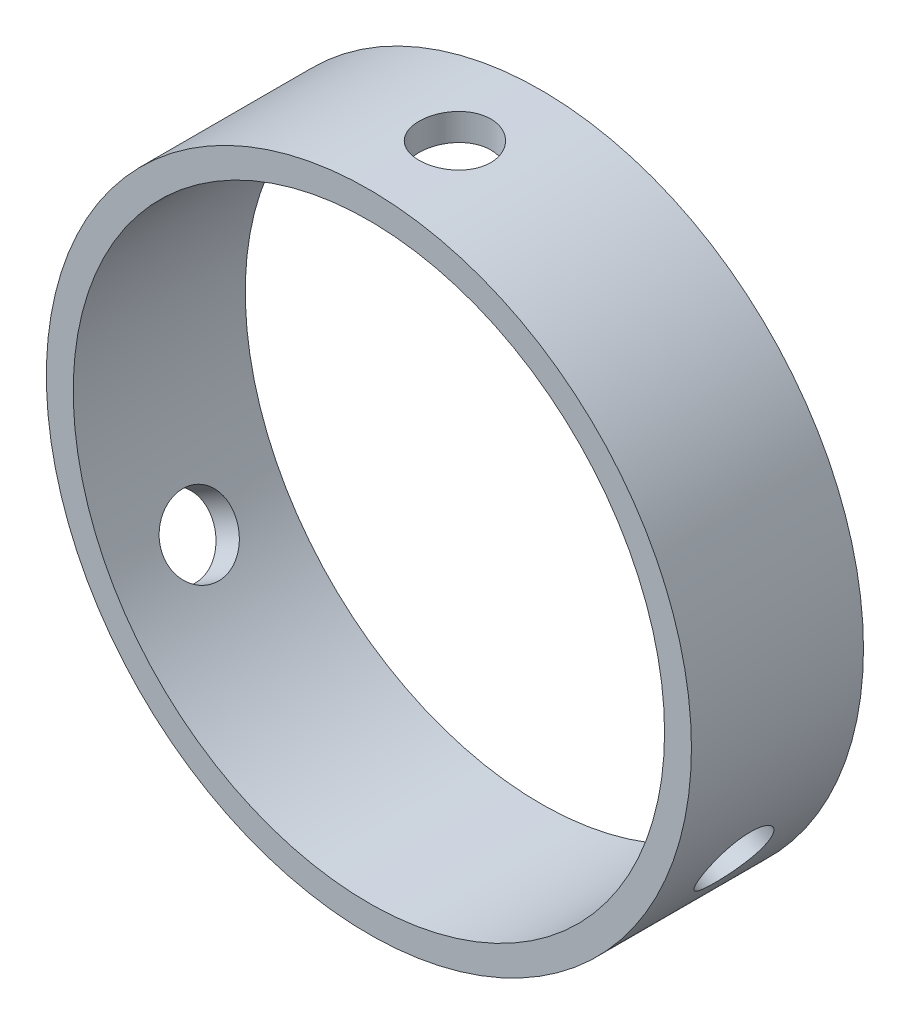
ISO-10303-21;
HEADER;
FILE_DESCRIPTION(('STEP AP214'),'2;1');
FILE_NAME('part.step','',(''),(''),'','','');
FILE_SCHEMA(('AUTOMOTIVE_DESIGN { 1 0 10303 214 1 1 1 1 }'));
ENDSEC;
DATA;
#1=APPLICATION_CONTEXT('core data for automotive mechanical design processes');
#2=APPLICATION_PROTOCOL_DEFINITION('international standard','automotive_design',2000,#1);
#3=PRODUCT_CONTEXT('',#1,'mechanical');
#4=PRODUCT('Part','Part','',(#3));
#5=PRODUCT_RELATED_PRODUCT_CATEGORY('part','',(#4));
#6=PRODUCT_DEFINITION_FORMATION('','',#4);
#7=PRODUCT_DEFINITION_CONTEXT('part definition',#1,'design');
#8=PRODUCT_DEFINITION('design','',#6,#7);
#9=PRODUCT_DEFINITION_SHAPE('','',#8);
#10=(LENGTH_UNIT() NAMED_UNIT(*) SI_UNIT(.MILLI.,.METRE.));
#11=(NAMED_UNIT(*) PLANE_ANGLE_UNIT() SI_UNIT($,.RADIAN.));
#12=(NAMED_UNIT(*) SI_UNIT($,.STERADIAN.) SOLID_ANGLE_UNIT());
#13=UNCERTAINTY_MEASURE_WITH_UNIT(LENGTH_MEASURE(1.E-05),#10,'distance_accuracy_value','');
#14=(GEOMETRIC_REPRESENTATION_CONTEXT(3) GLOBAL_UNCERTAINTY_ASSIGNED_CONTEXT((#13)) GLOBAL_UNIT_ASSIGNED_CONTEXT((#10,
#11,#12)) REPRESENTATION_CONTEXT('',''));
#15=CARTESIAN_POINT('',(0.,0.,0.));
#16=DIRECTION('',(0.,0.,1.));
#17=DIRECTION('',(1.,0.,0.));
#18=AXIS2_PLACEMENT_3D('',#15,#16,#17);
#19=CARTESIAN_POINT('',(0.,0.,15.24));
#20=DIRECTION('',(0.,0.,1.));
#21=DIRECTION('',(1.,0.,0.));
#22=AXIS2_PLACEMENT_3D('',#19,#20,#21);
#23=PLANE('',#22);
#24=CARTESIAN_POINT('',(0.,0.,15.24));
#25=DIRECTION('',(0.,0.,1.));
#26=DIRECTION('',(1.,0.,0.));
#27=AXIS2_PLACEMENT_3D('',#24,#25,#26);
#28=CIRCLE('',#27,57.15);
#29=CARTESIAN_POINT('',(57.15,0.,15.24));
#30=VERTEX_POINT('',#29);
#31=EDGE_CURVE('E10',#30,#30,#28,.T.);
#32=ORIENTED_EDGE('',*,*,#31,.T.);
#33=EDGE_LOOP('',(#32));
#34=FACE_BOUND('',#33,.T.);
#35=CARTESIAN_POINT('',(0.,0.,15.24));
#36=DIRECTION('',(0.,0.,1.));
#37=DIRECTION('',(1.,0.,0.));
#38=AXIS2_PLACEMENT_3D('',#35,#36,#37);
#39=CIRCLE('',#38,52.3875);
#40=CARTESIAN_POINT('',(52.3875,0.,15.24));
#41=VERTEX_POINT('',#40);
#42=EDGE_CURVE('E41',#41,#41,#39,.T.);
#43=ORIENTED_EDGE('',*,*,#42,.F.);
#44=EDGE_LOOP('',(#43));
#45=FACE_BOUND('',#44,.T.);
#46=ADVANCED_FACE('F30',(#34,#45),#23,.T.);
#47=CARTESIAN_POINT('',(0.,0.,-15.24));
#48=DIRECTION('',(0.,0.,1.));
#49=DIRECTION('',(1.,0.,0.));
#50=AXIS2_PLACEMENT_3D('',#47,#48,#49);
#51=PLANE('',#50);
#52=CARTESIAN_POINT('',(0.,0.,-15.24));
#53=DIRECTION('',(0.,0.,1.));
#54=DIRECTION('',(1.,0.,0.));
#55=AXIS2_PLACEMENT_3D('',#52,#53,#54);
#56=CIRCLE('',#55,57.15);
#57=CARTESIAN_POINT('',(57.15,0.,-15.24));
#58=VERTEX_POINT('',#57);
#59=EDGE_CURVE('E37',#58,#58,#56,.T.);
#60=ORIENTED_EDGE('',*,*,#59,.F.);
#61=EDGE_LOOP('',(#60));
#62=FACE_BOUND('',#61,.T.);
#63=CARTESIAN_POINT('',(0.,0.,-15.24));
#64=DIRECTION('',(0.,0.,1.));
#65=DIRECTION('',(1.,0.,0.));
#66=AXIS2_PLACEMENT_3D('',#63,#64,#65);
#67=CIRCLE('',#66,52.3875);
#68=CARTESIAN_POINT('',(52.3875,0.,-15.24));
#69=VERTEX_POINT('',#68);
#70=EDGE_CURVE('E45',#69,#69,#67,.T.);
#71=ORIENTED_EDGE('',*,*,#70,.T.);
#72=EDGE_LOOP('',(#71));
#73=FACE_BOUND('',#72,.T.);
#74=ADVANCED_FACE('F114',(#62,#73),#51,.F.);
#75=CARTESIAN_POINT('',(0.,0.,15.24));
#76=DIRECTION('',(0.,0.,-1.));
#77=DIRECTION('',(-1.,0.,0.));
#78=AXIS2_PLACEMENT_3D('',#75,#76,#77);
#79=CYLINDRICAL_SURFACE('',#78,57.15);
#80=CARTESIAN_POINT('',(-46.0118884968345,-33.8973246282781,0.));
#81=CARTESIAN_POINT('',(-46.0118870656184,-33.8973259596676,0.1778122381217));
#82=CARTESIAN_POINT('',(-46.0163488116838,-33.8912725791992,0.355596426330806));
#83=CARTESIAN_POINT('',(-46.0341459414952,-33.8670952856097,0.709952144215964));
#84=CARTESIAN_POINT('',(-46.0474834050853,-33.8489685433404,0.886523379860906));
#85=CARTESIAN_POINT('',(-46.0829049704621,-33.8007287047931,1.23726980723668));
#86=CARTESIAN_POINT('',(-46.1049958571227,-33.7706063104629,1.41144303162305));
#87=CARTESIAN_POINT('',(-46.1576955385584,-33.6985405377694,1.75608310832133));
#88=CARTESIAN_POINT('',(-46.1883074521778,-33.6565928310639,1.92654857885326));
#89=CARTESIAN_POINT('',(-46.2576849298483,-33.5611763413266,2.26232926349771));
#90=CARTESIAN_POINT('',(-46.2964422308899,-33.507719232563,2.42764950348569));
#91=CARTESIAN_POINT('',(-46.3817391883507,-33.3895504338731,2.75221864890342));
#92=CARTESIAN_POINT('',(-46.4282817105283,-33.3248345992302,2.91146529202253));
#93=CARTESIAN_POINT('',(-46.5286319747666,-33.1845797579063,3.22262180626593));
#94=CARTESIAN_POINT('',(-46.582435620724,-33.1090468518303,3.37453574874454));
#95=CARTESIAN_POINT('',(-46.6968070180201,-32.9475417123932,3.6701211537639));
#96=CARTESIAN_POINT('',(-46.757377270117,-32.8615656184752,3.81378953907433));
#97=CARTESIAN_POINT('',(-46.8848968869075,-32.6793719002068,4.09232713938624));
#98=CARTESIAN_POINT('',(-46.9518684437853,-32.5831185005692,4.22716279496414));
#99=CARTESIAN_POINT('',(-47.0913793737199,-32.381160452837,4.48657227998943));
#100=CARTESIAN_POINT('',(-47.1639207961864,-32.2754523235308,4.61114229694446));
#101=CARTESIAN_POINT('',(-47.3138346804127,-32.0552846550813,4.84905379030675));
#102=CARTESIAN_POINT('',(-47.3912055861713,-31.9408279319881,4.96239885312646));
#103=CARTESIAN_POINT('',(-47.5501084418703,-31.7037860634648,5.17714752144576));
#104=CARTESIAN_POINT('',(-47.6316419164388,-31.5811979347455,5.2785467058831));
#105=CARTESIAN_POINT('',(-47.7982888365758,-31.3284063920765,5.46884862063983));
#106=CARTESIAN_POINT('',(-47.883409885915,-31.1981865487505,5.55772287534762));
#107=CARTESIAN_POINT('',(-48.0563311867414,-30.9311630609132,5.72209622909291));
#108=CARTESIAN_POINT('',(-48.1441324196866,-30.7943569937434,5.79759035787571));
#109=CARTESIAN_POINT('',(-48.3215932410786,-30.515134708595,5.93458795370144));
#110=CARTESIAN_POINT('',(-48.4112520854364,-30.3727207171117,5.99609690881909));
#111=CARTESIAN_POINT('',(-48.5917059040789,-30.0831817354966,6.10472910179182));
#112=CARTESIAN_POINT('',(-48.6825012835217,-29.9360550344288,6.15184704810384));
#113=CARTESIAN_POINT('',(-48.9546451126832,-29.4904280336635,6.27064807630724));
#114=CARTESIAN_POINT('',(-49.1366928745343,-29.1862035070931,6.32050140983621));
#115=CARTESIAN_POINT('',(-49.4965717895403,-28.5716453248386,6.36001929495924));
#116=CARTESIAN_POINT('',(-49.6744030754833,-28.2613118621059,6.3496857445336));
#117=CARTESIAN_POINT('',(-50.0202000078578,-27.6446459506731,6.26939983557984));
#118=CARTESIAN_POINT('',(-50.1882057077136,-27.3383018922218,6.19971062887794));
#119=CARTESIAN_POINT('',(-50.5109738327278,-26.7372493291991,6.00308110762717));
#120=CARTESIAN_POINT('',(-50.6657360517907,-26.4425410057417,5.87613990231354));
#121=CARTESIAN_POINT('',(-50.9589714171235,-25.8729331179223,5.56833042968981));
#122=CARTESIAN_POINT('',(-51.0974088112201,-25.598077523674,5.38734675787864));
#123=CARTESIAN_POINT('',(-51.3550280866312,-25.0772436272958,4.97667216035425));
#124=CARTESIAN_POINT('',(-51.4742092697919,-24.8312663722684,4.74697946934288));
#125=CARTESIAN_POINT('',(-51.6920298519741,-24.3745982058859,4.2439295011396));
#126=CARTESIAN_POINT('',(-51.7905548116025,-24.1641050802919,3.97034306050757));
#127=CARTESIAN_POINT('',(-51.964926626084,-23.7868080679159,3.38806306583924));
#128=CARTESIAN_POINT('',(-52.0407734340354,-23.62000427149,3.07936943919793));
#129=CARTESIAN_POINT('',(-52.168939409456,-23.3355678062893,2.43545050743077));
#130=CARTESIAN_POINT('',(-52.2212517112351,-23.2179494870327,2.10021749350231));
#131=CARTESIAN_POINT('',(-52.3017825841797,-23.0359725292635,1.4128305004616));
#132=CARTESIAN_POINT('',(-52.3300020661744,-22.9716118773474,1.06067716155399));
#133=CARTESIAN_POINT('',(-52.3619997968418,-22.898582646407,0.35145696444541));
#134=CARTESIAN_POINT('',(-52.3659076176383,-22.889618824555,-0.00557366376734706));
#135=CARTESIAN_POINT('',(-52.3495923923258,-22.9269072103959,-0.716177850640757));
#136=CARTESIAN_POINT('',(-52.3293697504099,-22.9731584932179,-1.06975146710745));
#137=CARTESIAN_POINT('',(-52.2650644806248,-23.1190786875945,-1.76245991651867));
#138=CARTESIAN_POINT('',(-52.2210446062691,-23.2186071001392,-2.10163020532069));
#139=CARTESIAN_POINT('',(-52.1096118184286,-23.4676235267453,-2.75700925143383));
#140=CARTESIAN_POINT('',(-52.0421982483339,-23.6171129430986,-3.07321736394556));
#141=CARTESIAN_POINT('',(-51.8843730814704,-23.9618505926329,-3.67515233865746));
#142=CARTESIAN_POINT('',(-51.7938662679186,-24.1572880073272,-3.96074587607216));
#143=CARTESIAN_POINT('',(-51.5911284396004,-24.5872795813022,-4.49198913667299));
#144=CARTESIAN_POINT('',(-51.4788967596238,-24.8218349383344,-4.73763763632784));
#145=CARTESIAN_POINT('',(-51.2338277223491,-25.323815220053,-5.18313199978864));
#146=CARTESIAN_POINT('',(-51.1009004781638,-25.5913824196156,-5.38276816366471));
#147=CARTESIAN_POINT('',(-50.8171689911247,-26.1502557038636,-5.72912280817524));
#148=CARTESIAN_POINT('',(-50.6663650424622,-26.4415613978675,-5.8758421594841));
#149=CARTESIAN_POINT('',(-50.3504296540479,-27.0383150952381,-6.11185343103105));
#150=CARTESIAN_POINT('',(-50.185330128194,-27.3437309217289,-6.20126970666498));
#151=CARTESIAN_POINT('',(-49.8443969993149,-27.96037101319,-6.32051726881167));
#152=CARTESIAN_POINT('',(-49.6685637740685,-28.2715950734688,-6.35035065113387));
#153=CARTESIAN_POINT('',(-49.4011212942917,-28.7347114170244,-6.34982016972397));
#154=CARTESIAN_POINT('',(-49.3115567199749,-28.8881345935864,-6.34216191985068));
#155=CARTESIAN_POINT('',(-49.1316620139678,-29.1930386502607,-6.3119902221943));
#156=CARTESIAN_POINT('',(-49.0413321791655,-29.344520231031,-6.28948229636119));
#157=CARTESIAN_POINT('',(-48.8605568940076,-29.6445475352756,-6.22975908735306));
#158=CARTESIAN_POINT('',(-48.7701114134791,-29.7930921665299,-6.19253843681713));
#159=CARTESIAN_POINT('',(-48.5898781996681,-30.0861398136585,-6.10368229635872));
#160=CARTESIAN_POINT('',(-48.500090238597,-30.23064428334,-6.05205206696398));
#161=CARTESIAN_POINT('',(-48.3218608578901,-30.5147241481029,-5.93473684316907));
#162=CARTESIAN_POINT('',(-48.2334196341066,-30.6542988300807,-5.86904982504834));
#163=CARTESIAN_POINT('',(-48.0586720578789,-30.9275416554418,-5.72412512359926));
#164=CARTESIAN_POINT('',(-47.9723649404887,-31.0612119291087,-5.64489237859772));
#165=CARTESIAN_POINT('',(-47.8025667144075,-31.3218984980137,-5.47339322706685));
#166=CARTESIAN_POINT('',(-47.719076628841,-31.4489123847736,-5.3811221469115));
#167=CARTESIAN_POINT('',(-47.55571405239,-31.6954005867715,-5.18425529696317));
#168=CARTESIAN_POINT('',(-47.4758402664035,-31.8148776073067,-5.0796639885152));
#169=CARTESIAN_POINT('',(-47.3199699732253,-32.0462558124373,-4.85824813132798));
#170=CARTESIAN_POINT('',(-47.2439974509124,-32.1581112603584,-4.74135889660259));
#171=CARTESIAN_POINT('',(-47.097148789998,-32.3727970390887,-4.49669768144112));
#172=CARTESIAN_POINT('',(-47.0262708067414,-32.4756306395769,-4.36892967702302));
#173=CARTESIAN_POINT('',(-46.890218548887,-32.6717639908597,-4.10328703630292));
#174=CARTESIAN_POINT('',(-46.8250477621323,-32.7650579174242,-3.96540631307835));
#175=CARTESIAN_POINT('',(-46.7011206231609,-32.9414549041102,-3.68062394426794));
#176=CARTESIAN_POINT('',(-46.6423619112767,-33.0245617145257,-3.53372564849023));
#177=CARTESIAN_POINT('',(-46.5316284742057,-33.1804042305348,-3.23136658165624));
#178=CARTESIAN_POINT('',(-46.4796779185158,-33.2531030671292,-3.07587794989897));
#179=CARTESIAN_POINT('',(-46.3833533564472,-33.3873307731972,-2.75796380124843));
#180=CARTESIAN_POINT('',(-46.3389765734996,-33.4488637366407,-2.59554085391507));
#181=CARTESIAN_POINT('',(-46.2582739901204,-33.5603832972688,-2.26498564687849));
#182=CARTESIAN_POINT('',(-46.2219417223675,-33.6103791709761,-2.0968580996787));
#183=CARTESIAN_POINT('',(-46.1576782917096,-33.6985786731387,-1.7560277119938));
#184=CARTESIAN_POINT('',(-46.1297450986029,-33.7367851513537,-1.58332598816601));
#185=CARTESIAN_POINT('',(-46.0749405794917,-33.8116132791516,-1.17808987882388));
#186=CARTESIAN_POINT('',(-46.0513314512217,-33.8437301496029,-0.944260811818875));
#187=CARTESIAN_POINT('',(-46.0198064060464,-33.8865848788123,-0.473604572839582));
#188=CARTESIAN_POINT('',(-46.0118904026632,-33.8973228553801,-0.236777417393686));
#189=CARTESIAN_POINT('',(-46.0118884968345,-33.8973246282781,0.));
#190=B_SPLINE_CURVE_WITH_KNOTS('',3,(#80,#81,#82,#83,#84,#85,#86,#87,#88,#89,#90,#91,#92,#93,
#94,#95,#96,#97,#98,#99,#100,#101,#102,#103,#104,#105,#106,#107,#108,#109,#110,#111,#112,#113,
#114,#115,#116,#117,#118,#119,#120,#121,#122,#123,#124,#125,#126,#127,#128,#129,#130,#131,#132,
#133,#134,#135,#136,#137,#138,#139,#140,#141,#142,#143,#144,#145,#146,#147,#148,#149,#150,#151,
#152,#153,#154,#155,#156,#157,#158,#159,#160,#161,#162,#163,#164,#165,#166,#167,#168,#169,#170,
#171,#172,#173,#174,#175,#176,#177,#178,#179,#180,#181,#182,#183,#184,#185,#186,#187,#188,#189),
.UNSPECIFIED.,.T.,.F.,(4,2,2,2,2,2,2,2,2,2,2,2,2,2,2,2,2,2,2,2,2,2,2,2,2,2,2,2,2,2,2,2,2,2,2,2,
2,2,2,2,2,2,2,2,2,2,2,2,2,2,2,2,2,2,4),(0.,0.533229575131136,1.06658414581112,1.60035293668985,
2.13431735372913,2.66774268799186,3.20136481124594,3.73468715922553,4.26820726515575,
4.80364915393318,5.33928900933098,5.8747571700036,6.41042288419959,6.94728744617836,
7.48435101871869,8.02120347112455,8.55825308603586,9.62673898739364,10.695191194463,
11.7589309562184,12.822687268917,13.8887316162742,14.9548146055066,16.0266563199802,
17.0985002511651,18.1706566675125,19.2427725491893,20.3091695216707,21.3755486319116,
22.4391293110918,23.5027398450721,24.5708087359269,25.6389103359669,26.7117875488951,
27.7846471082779,28.8551704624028,29.925656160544,30.458590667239,30.9913271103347,
31.5242580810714,32.0569947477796,32.5898081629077,33.1224277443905,33.6552387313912,
34.1878573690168,34.7234326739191,35.2588130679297,35.7945183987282,36.3300259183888,
36.8673858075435,37.4045482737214,37.941277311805,38.4778765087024,39.187936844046,
39.8979932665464),.UNSPECIFIED.);
#191=CARTESIAN_POINT('',(-46.0118884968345,-33.8973246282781,0.));
#192=VERTEX_POINT('',#191);
#193=EDGE_CURVE('E96',#192,#192,#190,.T.);
#194=ORIENTED_EDGE('',*,*,#193,.F.);
#195=EDGE_LOOP('',(#194));
#196=FACE_BOUND('',#195,.T.);
#197=CARTESIAN_POINT('',(52.3618884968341,-22.8988020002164,0.));
#198=CARTESIAN_POINT('',(52.3618889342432,-22.8988000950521,0.1778122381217));
#199=CARTESIAN_POINT('',(52.3588774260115,-22.9056907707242,0.355596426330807));
#200=CARTESIAN_POINT('',(52.3468378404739,-22.93319218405,0.709952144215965));
#201=CARTESIAN_POINT('',(52.3378083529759,-22.9538061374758,0.886523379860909));
#202=CARTESIAN_POINT('',(52.3137422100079,-23.0086020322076,1.23726980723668));
#203=CARTESIAN_POINT('',(52.2987008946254,-23.0427944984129,1.41144303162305));
#204=CARTESIAN_POINT('',(52.2626399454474,-23.1244666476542,1.75608310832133));
#205=CARTESIAN_POINT('',(52.2416181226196,-23.1719511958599,1.92654857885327));
#206=CARTESIAN_POINT('',(52.1936737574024,-23.2797420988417,2.26232926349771));
#207=CARTESIAN_POINT('',(52.166757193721,-23.3400354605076,2.42764950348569));
#208=CARTESIAN_POINT('',(52.1070684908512,-23.4729891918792,2.75221864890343));
#209=CARTESIAN_POINT('',(52.0742941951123,-23.5456541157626,2.91146529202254));
#210=CARTESIAN_POINT('',(52.0030050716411,-23.7026874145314,3.22262180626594));
#211=CARTESIAN_POINT('',(51.9644934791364,-23.7870491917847,3.37453574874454));
#212=CARTESIAN_POINT('',(51.8818116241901,-23.966850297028,3.67012115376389));
#213=CARTESIAN_POINT('',(51.8376392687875,-24.0622937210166,3.81378953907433));
#214=CARTESIAN_POINT('',(51.7436146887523,-24.2638258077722,4.09232713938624));
#215=CARTESIAN_POINT('',(51.6937425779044,-24.3699515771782,4.22716279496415));
#216=CARTESIAN_POINT('',(51.5885972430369,-24.5917506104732,4.48657227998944));
#217=CARTESIAN_POINT('',(51.5333220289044,-24.707427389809,4.61114229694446));
#218=CARTESIAN_POINT('',(51.4176081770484,-24.9473404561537,4.84905379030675));
#219=CARTESIAN_POINT('',(51.3571712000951,-25.0715739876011,4.96239885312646));
#220=CARTESIAN_POINT('',(51.2313383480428,-25.3277088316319,5.17714752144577));
#221=CARTESIAN_POINT('',(51.1659406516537,-25.4596129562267,5.27854670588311));
#222=CARTESIAN_POINT('',(51.0303402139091,-25.7303291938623,5.46884862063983));
#223=CARTESIAN_POINT('',(50.9601270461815,-25.8691561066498,5.55772287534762));
#224=CARTESIAN_POINT('',(50.8153385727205,-26.1524220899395,5.72209622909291));
#225=CARTESIAN_POINT('',(50.7407616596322,-26.2968632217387,5.79759035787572));
#226=CARTESIAN_POINT('',(50.5876784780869,-26.5901599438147,5.93458795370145));
#227=CARTESIAN_POINT('',(50.5091737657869,-26.7390137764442,5.9960969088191));
#228=CARTESIAN_POINT('',(50.3486525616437,-27.0400608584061,6.10472910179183));
#229=CARTESIAN_POINT('',(50.2666347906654,-27.1922553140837,6.15184704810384));
#230=CARTESIAN_POINT('',(50.0167824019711,-27.6507522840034,6.27064807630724));
#231=CARTESIAN_POINT('',(49.8443401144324,-27.9605225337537,6.32050140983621));
#232=CARTESIAN_POINT('',(49.4920565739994,-28.5794659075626,6.36001929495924));
#233=CARTESIAN_POINT('',(49.3122155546,-28.8886390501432,6.3496857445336));
#234=CARTESIAN_POINT('',(48.9510656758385,-29.4964409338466,6.26939983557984));
#235=CARTESIAN_POINT('',(48.7697667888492,-29.795110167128,6.19971062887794));
#236=CARTESIAN_POINT('',(48.4106240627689,-30.3751618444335,6.00308110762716));
#237=CARTESIAN_POINT('',(48.2327802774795,-30.6565440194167,5.87613990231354));
#238=CARTESIAN_POINT('',(47.8861030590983,-31.1952972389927,5.5683304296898));
#239=CARTESIAN_POINT('',(47.7172898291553,-31.4526153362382,5.38734675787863));
#240=CARTESIAN_POINT('',(47.3950440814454,-31.9361371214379,4.97667216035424));
#241=CARTESIAN_POINT('',(47.2416121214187,-32.1623396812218,4.74697946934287));
#242=CARTESIAN_POINT('',(46.9550361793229,-32.57931192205,4.24392950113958));
#243=CARTESIAN_POINT('',(46.8220062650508,-32.769883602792,3.97034306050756));
#244=CARTESIAN_POINT('',(46.582443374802,-33.109542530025,3.38806306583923));
#245=CARTESIAN_POINT('',(46.4759104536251,-33.2586296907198,3.07936943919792));
#246=CARTESIAN_POINT('',(46.293664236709,-33.5118429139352,2.43545050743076));
#247=CARTESIAN_POINT('',(46.2179599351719,-33.6159558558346,2.1002174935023));
#248=CARTESIAN_POINT('',(46.1006287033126,-33.7766861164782,1.41283050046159));
#249=CARTESIAN_POINT('',(46.0590004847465,-33.8333052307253,1.06067716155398));
#250=CARTESIAN_POINT('',(46.011754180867,-33.8975306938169,0.3514569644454));
#251=CARTESIAN_POINT('',(46.0059451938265,-33.9053968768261,-0.005573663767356));
#252=CARTESIAN_POINT('',(46.0300802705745,-33.8726232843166,-0.716177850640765));
#253=CARTESIAN_POINT('',(46.060023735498,-33.8319843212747,-1.06975146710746));
#254=CARTESIAN_POINT('',(46.1542416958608,-33.7033342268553,-1.76245991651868));
#255=CARTESIAN_POINT('',(46.218425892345,-33.6154476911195,-2.1016302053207));
#256=CARTESIAN_POINT('',(46.3783640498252,-33.3944358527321,-2.75700925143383));
#257=CARTESIAN_POINT('',(46.4741188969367,-33.2613092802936,-3.07321736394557));
#258=CARTESIAN_POINT('',(46.6937578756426,-32.9522598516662,-3.67515233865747));
#259=CARTESIAN_POINT('',(46.817758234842,-32.7761599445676,-3.96074587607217));
#260=CARTESIAN_POINT('',(47.0887729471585,-32.3855880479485,-4.49198913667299));
#261=CARTESIAN_POINT('',(47.2357880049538,-32.1711148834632,-4.73763763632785));
#262=CARTESIAN_POINT('',(47.5479811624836,-31.7078887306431,-5.18313199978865));
#263=CARTESIAN_POINT('',(47.7132375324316,-31.4589867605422,-5.38276816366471));
#264=CARTESIAN_POINT('',(48.0553702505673,-30.9338314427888,-5.72912280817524));
#265=CARTESIAN_POINT('',(48.2322464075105,-30.6575785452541,-5.87584215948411));
#266=CARTESIAN_POINT('',(48.5910825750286,-30.0855936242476,-6.11185343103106));
#267=CARTESIAN_POINT('',(48.7730306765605,-29.7899053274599,-6.20126970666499));
#268=CARTESIAN_POINT('',(49.1365900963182,-29.1863285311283,-6.32051726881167));
#269=CARTESIAN_POINT('',(49.3182014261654,-28.8784404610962,-6.35035065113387));
#270=CARTESIAN_POINT('',(49.5855507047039,-28.4152703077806,-6.34982016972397));
#271=CARTESIAN_POINT('',(49.6736367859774,-28.2609935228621,-6.34216191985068));
#272=CARTESIAN_POINT('',(49.8477440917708,-27.9527481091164,-6.3119902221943));
#273=CARTESIAN_POINT('',(49.9337660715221,-27.7987793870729,-6.28948229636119));
#274=CARTESIAN_POINT('',(50.1032096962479,-27.4922097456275,-6.22975908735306));
#275=CARTESIAN_POINT('',(50.1866303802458,-27.3396093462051,-6.19253843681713));
#276=CARTESIAN_POINT('',(50.3503004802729,-27.0369989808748,-6.10368229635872));
#277=CARTESIAN_POINT('',(50.4305510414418,-26.8869880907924,-6.05205206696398));
#278=CARTESIAN_POINT('',(50.5874567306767,-26.590596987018,-5.93473684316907));
#279=CARTESIAN_POINT('',(50.6641113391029,-26.4442172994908,-5.86904982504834));
#280=CARTESIAN_POINT('',(50.8133727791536,-26.1562600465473,-5.72412512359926));
#281=CARTESIAN_POINT('',(50.8859810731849,-26.0146807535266,-5.64489237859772));
#282=CARTESIAN_POINT('',(51.0268431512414,-25.7372878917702,-5.47339322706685));
#283=CARTESIAN_POINT('',(51.0950953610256,-25.6014764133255,-5.38112214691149));
#284=CARTESIAN_POINT('',(51.2268791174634,-25.3367561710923,-5.18425529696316));
#285=CARTESIAN_POINT('',(51.2904123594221,-25.207844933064,-5.07966398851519));
#286=CARTESIAN_POINT('',(51.4128566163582,-24.957168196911,-4.85824813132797));
#287=CARTESIAN_POINT('',(51.4717400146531,-24.835446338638,-4.74135889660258));
#288=CARTESIAN_POINT('',(51.5842390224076,-24.6009287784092,-4.49669768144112));
#289=CARTESIAN_POINT('',(51.6378565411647,-24.4881298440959,-4.36892967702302));
#290=CARTESIAN_POINT('',(51.7396868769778,-24.2722384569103,-4.10328703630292));
#291=CARTESIAN_POINT('',(51.7878963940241,-24.1691519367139,-3.96540631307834));
#292=CARTESIAN_POINT('',(51.8786970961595,-23.9736293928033,-3.68062394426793));
#293=CARTESIAN_POINT('',(51.9212903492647,-23.8811894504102,-3.53372564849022));
#294=CARTESIAN_POINT('',(52.0008872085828,-23.7073702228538,-3.23136658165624));
#295=CARTESIAN_POINT('',(52.0378709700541,-23.6260303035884,-3.07587794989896));
#296=CARTESIAN_POINT('',(52.1059532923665,-23.4754969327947,-2.75796380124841));
#297=CARTESIAN_POINT('',(52.1370540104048,-23.406299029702,-2.59554085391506));
#298=CARTESIAN_POINT('',(52.193281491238,-23.2806487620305,-2.26498564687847));
#299=CARTESIAN_POINT('',(52.2184130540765,-23.2241861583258,-2.09685809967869));
#300=CARTESIAN_POINT('',(52.2626643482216,-23.1244326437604,-1.75602771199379));
#301=CARTESIAN_POINT('',(52.2817855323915,-23.0811385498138,-1.58332598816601));
#302=CARTESIAN_POINT('',(52.3191863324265,-22.9962623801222,-1.17808987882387));
#303=CARTESIAN_POINT('',(52.3351957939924,-22.9597578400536,-0.944260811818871));
#304=CARTESIAN_POINT('',(52.3565465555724,-22.9110289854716,-0.47360457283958));
#305=CARTESIAN_POINT('',(52.3618879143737,-22.8988045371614,-0.236777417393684));
#306=CARTESIAN_POINT('',(52.3618884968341,-22.8988020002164,0.));
#307=B_SPLINE_CURVE_WITH_KNOTS('',3,(#197,#198,#199,#200,#201,#202,#203,#204,#205,#206,#207,
#208,#209,#210,#211,#212,#213,#214,#215,#216,#217,#218,#219,#220,#221,#222,#223,#224,#225,#226,
#227,#228,#229,#230,#231,#232,#233,#234,#235,#236,#237,#238,#239,#240,#241,#242,#243,#244,#245,
#246,#247,#248,#249,#250,#251,#252,#253,#254,#255,#256,#257,#258,#259,#260,#261,#262,#263,#264,
#265,#266,#267,#268,#269,#270,#271,#272,#273,#274,#275,#276,#277,#278,#279,#280,#281,#282,#283,
#284,#285,#286,#287,#288,#289,#290,#291,#292,#293,#294,#295,#296,#297,#298,#299,#300,#301,#302,
#303,#304,#305,#306),.UNSPECIFIED.,.T.,.F.,(4,2,2,2,2,2,2,2,2,2,2,2,2,2,2,2,2,2,2,2,2,2,2,2,2,2,
2,2,2,2,2,2,2,2,2,2,2,2,2,2,2,2,2,2,2,2,2,2,2,2,2,2,2,2,4),(0.,0.533229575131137,
1.06658414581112,1.60035293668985,2.13431735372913,2.66774268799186,3.20136481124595,
3.73468715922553,4.26820726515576,4.80364915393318,5.33928900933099,5.87475717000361,
6.41042288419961,6.94728744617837,7.4843510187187,8.02120347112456,8.55825308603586,
9.62673898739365,10.695191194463,11.7589309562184,12.822687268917,13.8887316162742,
14.9548146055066,16.0266563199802,17.0985002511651,18.1706566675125,19.2427725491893,
20.3091695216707,21.3755486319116,22.4391293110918,23.5027398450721,24.5708087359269,
25.6389103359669,26.7117875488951,27.7846471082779,28.8551704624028,29.925656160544,
30.458590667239,30.9913271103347,31.5242580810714,32.0569947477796,32.5898081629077,
33.1224277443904,33.6552387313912,34.1878573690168,34.7234326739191,35.2588130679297,
35.7945183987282,36.3300259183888,36.8673858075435,37.4045482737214,37.941277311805,
38.4778765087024,39.187936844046,39.8979932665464),.UNSPECIFIED.);
#308=CARTESIAN_POINT('',(52.3618884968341,-22.8988020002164,0.));
#309=VERTEX_POINT('',#308);
#310=EDGE_CURVE('E78',#309,#309,#307,.T.);
#311=ORIENTED_EDGE('',*,*,#310,.F.);
#312=EDGE_LOOP('',(#311));
#313=FACE_BOUND('',#312,.T.);
#314=CARTESIAN_POINT('',(0.,57.15,6.35));
#315=CARTESIAN_POINT('',(0.177816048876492,57.1500005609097,6.35000186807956));
#316=CARTESIAN_POINT('',(0.355604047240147,57.1491684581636,6.34252829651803));
#317=CARTESIAN_POINT('',(0.709967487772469,57.145864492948,6.31269028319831));
#318=CARTESIAN_POINT('',(0.886542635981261,57.1433922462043,6.29032235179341));
#319=CARTESIAN_POINT('',(1.23729697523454,57.13687422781,6.23083196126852));
#320=CARTESIAN_POINT('',(1.41147420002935,57.1328272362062,6.19369806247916));
#321=CARTESIAN_POINT('',(1.75612236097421,57.1232725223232,6.10493324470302));
#322=CARTESIAN_POINT('',(1.92659191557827,57.1177642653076,6.05329701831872));
#323=CARTESIAN_POINT('',(2.26238128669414,57.1054492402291,5.93596916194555));
#324=CARTESIAN_POINT('',(2.42770611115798,57.0986437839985,5.87029172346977));
#325=CARTESIAN_POINT('',(2.75228402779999,57.0839192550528,5.72529804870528));
#326=CARTESIAN_POINT('',(2.91153485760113,57.0759997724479,5.64597678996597));
#327=CARTESIAN_POINT('',(3.22269899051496,57.0592759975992,5.47432784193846));
#328=CARTESIAN_POINT('',(3.37461636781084,57.0504722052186,5.38200748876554));
#329=CARTESIAN_POINT('',(3.67020768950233,57.0322190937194,5.18494353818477));
#330=CARTESIAN_POINT('',(3.81387855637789,57.0227695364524,5.08019534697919));
#331=CARTESIAN_POINT('',(4.09241269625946,57.0034579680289,4.85864558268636));
#332=CARTESIAN_POINT('',(4.22724289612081,56.9935946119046,4.74180254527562));
#333=CARTESIAN_POINT('',(4.48664142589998,56.9737613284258,4.49714869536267));
#334=CARTESIAN_POINT('',(4.61120594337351,56.9637913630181,4.36933384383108));
#335=CARTESIAN_POINT('',(4.84910668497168,56.9440331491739,4.10371076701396));
#336=CARTESIAN_POINT('',(4.96244648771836,56.9342448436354,3.96590575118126));
#337=CARTESIAN_POINT('',(5.17718505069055,56.915119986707,3.68117684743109));
#338=CARTESIAN_POINT('',(5.27857938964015,56.9057836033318,3.53424961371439));
#339=CARTESIAN_POINT('',(5.46887584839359,56.8878111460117,3.23200533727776));
#340=CARTESIAN_POINT('',(5.55774901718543,56.8791767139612,3.0766699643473));
#341=CARTESIAN_POINT('',(5.7221200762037,56.8628759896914,2.75895795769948));
#342=CARTESIAN_POINT('',(5.79761299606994,56.8552100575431,2.59657873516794));
#343=CARTESIAN_POINT('',(5.93460809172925,56.8410739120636,2.26603253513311));
#344=CARTESIAN_POINT('',(5.99611576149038,56.8346032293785,2.09786786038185));
#345=CARTESIAN_POINT('',(6.10474532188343,56.8230369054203,1.75689037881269));
#346=CARTESIAN_POINT('',(6.15186192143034,56.8179417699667,1.58407588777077));
#347=CARTESIAN_POINT('',(6.27065904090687,56.8050000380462,1.06207377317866));
#348=CARTESIAN_POINT('',(6.320509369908,56.7994199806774,0.707578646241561));
#349=CARTESIAN_POINT('',(6.3600194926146,56.7950085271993,-0.0045937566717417));
#350=CARTESIAN_POINT('',(6.34968121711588,56.796176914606,-0.362270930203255));
#351=CARTESIAN_POINT('',(6.26938780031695,56.8050955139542,-1.06919697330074));
#352=CARTESIAN_POINT('',(6.19970056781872,56.8128161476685,-1.41847647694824));
#353=CARTESIAN_POINT('',(6.00308367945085,56.8339262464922,-2.10033818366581));
#354=CARTESIAN_POINT('',(5.87615308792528,56.8473158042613,-2.43292011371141));
#355=CARTESIAN_POINT('',(5.56836564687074,56.8782881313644,-3.07280340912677));
#356=CARTESIAN_POINT('',(5.38739092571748,56.8958800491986,-3.3800476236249));
#357=CARTESIAN_POINT('',(4.97673546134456,56.9332677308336,-3.95990361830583));
#358=CARTESIAN_POINT('',(4.74705295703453,56.9530635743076,-4.23251414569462));
#359=CARTESIAN_POINT('',(4.24401024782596,56.992760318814,-4.73692207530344));
#360=CARTESIAN_POINT('',(3.97041879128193,57.0126612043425,-4.96848891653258));
#361=CARTESIAN_POINT('',(3.38812448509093,57.0502242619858,-5.38244538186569));
#362=CARTESIAN_POINT('',(3.07942158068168,57.0678864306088,-5.5648349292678));
#363=CARTESIAN_POINT('',(2.43550006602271,57.0989898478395,-5.87525419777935));
#364=CARTESIAN_POINT('',(2.10027521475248,57.1124300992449,-6.00327107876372));
#365=CARTESIAN_POINT('',(1.41290597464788,57.1335657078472,-6.20113623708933));
#366=CARTESIAN_POINT('',(1.06076221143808,57.1412612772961,-6.27098666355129));
#367=CARTESIAN_POINT('',(0.351546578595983,57.1500130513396,-6.35024098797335));
#368=CARTESIAN_POINT('',(-0.00548934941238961,57.1511041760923,-6.3599628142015));
#369=CARTESIAN_POINT('',(-0.71610533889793,57.1466180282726,-6.31952065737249));
#370=CARTESIAN_POINT('',(-1.06968545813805,57.1410408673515,-6.26935767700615));
#371=CARTESIAN_POINT('',(-1.76242681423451,57.1238668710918,-6.11083379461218));
#372=CARTESIAN_POINT('',(-2.1016227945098,57.1122855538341,-6.00262289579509));
#373=CARTESIAN_POINT('',(-2.75705020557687,57.0844013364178,-5.73122969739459));
#374=CARTESIAN_POINT('',(-3.07328100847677,57.0680983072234,-5.56804589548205));
#375=CARTESIAN_POINT('',(-3.67523162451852,57.0325045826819,-5.19055900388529));
#376=CARTESIAN_POINT('',(-3.96082056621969,57.0132018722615,-4.97604837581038));
#377=CARTESIAN_POINT('',(-4.49205294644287,56.9738102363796,-4.502291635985));
#378=CARTESIAN_POINT('',(-4.73769514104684,56.9537212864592,-4.24304413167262));
#379=CARTESIAN_POINT('',(-5.18317562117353,56.9149149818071,-3.68578465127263));
#380=CARTESIAN_POINT('',(-5.38280436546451,56.8962041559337,-3.38760466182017));
#381=CARTESIAN_POINT('',(-5.72914599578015,56.8623760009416,-2.7617497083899));
#382=CARTESIAN_POINT('',(-5.87585974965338,56.847258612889,-2.43407522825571));
#383=CARTESIAN_POINT('',(-6.11186737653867,56.8223696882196,-1.75930033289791));
#384=CARTESIAN_POINT('',(-6.2012831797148,56.8125868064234,-1.41224288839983));
#385=CARTESIAN_POINT('',(-6.32052646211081,56.7994472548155,-0.707729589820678));
#386=CARTESIAN_POINT('',(-6.3503560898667,56.7960903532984,-0.350274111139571));
#387=CARTESIAN_POINT('',(-6.34981731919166,56.7961452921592,0.184519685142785));
#388=CARTESIAN_POINT('',(-6.34215701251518,56.7970045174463,0.362161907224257));
#389=CARTESIAN_POINT('',(-6.31198264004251,56.8003667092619,0.716146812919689));
#390=CARTESIAN_POINT('',(-6.28947409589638,56.8028690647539,0.892489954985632));
#391=CARTESIAN_POINT('',(-6.22975114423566,56.809449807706,1.24269139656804));
#392=CARTESIAN_POINT('',(-6.19253136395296,56.8135287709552,1.41654876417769));
#393=CARTESIAN_POINT('',(-6.10367852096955,56.823143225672,1.76043447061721));
#394=CARTESIAN_POINT('',(-6.05205071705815,56.8286781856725,1.93046418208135));
#395=CARTESIAN_POINT('',(-5.93474215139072,56.841048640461,2.26558118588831));
#396=CARTESIAN_POINT('',(-5.86905942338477,56.8478843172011,2.43066778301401));
#397=CARTESIAN_POINT('',(-5.72414489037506,56.8626587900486,2.75465899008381));
#398=CARTESIAN_POINT('',(-5.64491802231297,56.8705971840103,2.91356582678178));
#399=CARTESIAN_POINT('',(-5.47343199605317,56.8873576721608,3.22421006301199));
#400=CARTESIAN_POINT('',(-5.38116816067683,56.8961800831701,3.37594486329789));
#401=CARTESIAN_POINT('',(-5.18431690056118,56.9144544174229,3.67107758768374));
#402=CARTESIAN_POINT('',(-5.07973393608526,56.9239061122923,3.8144785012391));
#403=CARTESIAN_POINT('',(-4.85832691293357,56.9432311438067,4.09279331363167));
#404=CARTESIAN_POINT('',(-4.74143725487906,56.9531065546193,4.22765488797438));
#405=CARTESIAN_POINT('',(-4.49677402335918,56.9729460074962,4.48701391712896));
#406=CARTESIAN_POINT('',(-4.36900442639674,56.9829100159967,4.61151512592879));
#407=CARTESIAN_POINT('',(-4.1033574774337,57.0026552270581,4.84940891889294));
#408=CARTESIAN_POINT('',(-3.96547404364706,57.0124363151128,4.96279472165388));
#409=CARTESIAN_POINT('',(-3.68068516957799,57.0315299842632,5.17753314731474));
#410=CARTESIAN_POINT('',(-3.53378308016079,57.0408427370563,5.27889019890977));
#411=CARTESIAN_POINT('',(-3.23142123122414,57.058771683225,5.4692264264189));
#412=CARTESIAN_POINT('',(-3.07593391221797,57.0673853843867,5.55816206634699));
#413=CARTESIAN_POINT('',(-2.75802228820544,57.0836328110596,5.72257173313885));
#414=CARTESIAN_POINT('',(-2.59560055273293,57.091266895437,5.79805069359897));
#415=CARTESIAN_POINT('',(-2.26504776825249,57.1053359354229,5.93498377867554));
#416=CARTESIAN_POINT('',(-2.09692142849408,57.1117718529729,5.99644916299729));
#417=CARTESIAN_POINT('',(-1.75609365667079,57.1232677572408,6.10496706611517));
#418=CARTESIAN_POINT('',(-1.58339334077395,57.1283280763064,6.15202306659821));
#419=CARTESIAN_POINT('',(-1.17814740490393,57.1383207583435,6.2442353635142));
#420=CARTESIAN_POINT('',(-0.944306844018,57.1426827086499,6.2838578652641));
#421=CARTESIAN_POINT('',(-0.473627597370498,57.1485219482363,6.3367388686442));
#422=CARTESIAN_POINT('',(-0.236788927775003,57.149999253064,6.34999751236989));
#423=CARTESIAN_POINT('',(0.,57.15,6.35));
#424=B_SPLINE_CURVE_WITH_KNOTS('',3,(#314,#315,#316,#317,#318,#319,#320,#321,#322,#323,#324,
#325,#326,#327,#328,#329,#330,#331,#332,#333,#334,#335,#336,#337,#338,#339,#340,#341,#342,#343,
#344,#345,#346,#347,#348,#349,#350,#351,#352,#353,#354,#355,#356,#357,#358,#359,#360,#361,#362,
#363,#364,#365,#366,#367,#368,#369,#370,#371,#372,#373,#374,#375,#376,#377,#378,#379,#380,#381,
#382,#383,#384,#385,#386,#387,#388,#389,#390,#391,#392,#393,#394,#395,#396,#397,#398,#399,#400,
#401,#402,#403,#404,#405,#406,#407,#408,#409,#410,#411,#412,#413,#414,#415,#416,#417,#418,#419,
#420,#421,#422,#423),.UNSPECIFIED.,.T.,.F.,(4,2,2,2,2,2,2,2,2,2,2,2,2,2,2,2,2,2,2,2,2,2,2,2,2,2,
2,2,2,2,2,2,2,2,2,2,2,2,2,2,2,2,2,2,2,2,2,2,2,2,2,2,2,2,4),(0.,0.533241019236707,
1.06660701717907,1.60038703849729,2.13436266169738,2.66780112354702,3.20143637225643,
3.73477165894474,4.26830470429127,4.80373155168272,5.33935635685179,5.87480984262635,
6.41046089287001,6.94733081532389,7.48439975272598,8.02125734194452,8.55831207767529,
9.62681253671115,10.6952787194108,11.7589471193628,12.8226329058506,13.8886557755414,
14.9547171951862,16.0265894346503,17.0984633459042,18.1705902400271,19.2426775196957,
20.3090912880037,21.3754872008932,22.4391405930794,23.5028230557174,24.570881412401,
25.6389730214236,26.7118365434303,27.7846824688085,28.8552377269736,29.9257543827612,
30.4586639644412,30.9913754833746,31.5242817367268,32.0569937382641,32.5897803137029,
33.122373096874,33.6551574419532,34.1877494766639,34.723339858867,35.2587353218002,
35.7944554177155,36.3299776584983,36.8673321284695,37.4044891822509,37.9412131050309,
38.4778072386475,39.1879020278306,39.8979929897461),.UNSPECIFIED.);
#425=CARTESIAN_POINT('',(0.,57.15,6.35));
#426=VERTEX_POINT('',#425);
#427=EDGE_CURVE('E57',#426,#426,#424,.T.);
#428=ORIENTED_EDGE('',*,*,#427,.F.);
#429=EDGE_LOOP('',(#428));
#430=FACE_BOUND('',#429,.T.);
#431=ORIENTED_EDGE('',*,*,#31,.F.);
#432=EDGE_LOOP('',(#431));
#433=FACE_BOUND('',#432,.T.);
#434=ORIENTED_EDGE('',*,*,#59,.T.);
#435=EDGE_LOOP('',(#434));
#436=FACE_BOUND('',#435,.T.);
#437=ADVANCED_FACE('F32',(#196,#313,#430,#433,#436),#79,.T.);
#438=CARTESIAN_POINT('',(0.,0.,15.24));
#439=DIRECTION('',(0.,0.,-1.));
#440=DIRECTION('',(-1.,0.,0.));
#441=AXIS2_PLACEMENT_3D('',#438,#439,#440);
#442=CYLINDRICAL_SURFACE('',#441,52.3875);
#443=CARTESIAN_POINT('',(-41.8593839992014,-31.4998750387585,0.));
#444=CARTESIAN_POINT('',(-41.8593824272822,-31.4998764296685,0.177699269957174));
#445=CARTESIAN_POINT('',(-41.8639053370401,-31.4938692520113,0.355369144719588));
#446=CARTESIAN_POINT('',(-41.8819446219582,-31.469876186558,0.709495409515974));
#447=CARTESIAN_POINT('',(-41.8954630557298,-31.4518875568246,0.885951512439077));
#448=CARTESIAN_POINT('',(-41.9313600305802,-31.4040139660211,1.23646300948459));
#449=CARTESIAN_POINT('',(-41.9537452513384,-31.3741200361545,1.41051649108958));
#450=CARTESIAN_POINT('',(-42.0071370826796,-31.3025970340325,1.75491768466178));
#451=CARTESIAN_POINT('',(-42.038146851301,-31.2609636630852,1.92526401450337));
#452=CARTESIAN_POINT('',(-42.1084086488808,-31.1662565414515,2.26080401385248));
#453=CARTESIAN_POINT('',(-42.1476520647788,-31.1131947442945,2.42600286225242));
#454=CARTESIAN_POINT('',(-42.2339952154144,-30.995888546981,2.75033574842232));
#455=CARTESIAN_POINT('',(-42.2810978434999,-30.9316400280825,2.90946752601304));
#456=CARTESIAN_POINT('',(-42.3826249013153,-30.7923802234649,3.22040706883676));
#457=CARTESIAN_POINT('',(-42.4370452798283,-30.7173748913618,3.37221882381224));
#458=CARTESIAN_POINT('',(-42.5526883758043,-30.5569737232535,3.6676158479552));
#459=CARTESIAN_POINT('',(-42.6139136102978,-30.4715740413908,3.81119804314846));
#460=CARTESIAN_POINT('',(-42.7428121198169,-30.2905029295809,4.08968671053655));
#461=CARTESIAN_POINT('',(-42.8105122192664,-30.1947885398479,4.22455283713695));
#462=CARTESIAN_POINT('',(-42.951488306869,-29.9939138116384,4.48403378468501));
#463=CARTESIAN_POINT('',(-43.0247663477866,-29.8887499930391,4.60864479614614));
#464=CARTESIAN_POINT('',(-43.1761409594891,-29.6696600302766,4.84665120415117));
#465=CARTESIAN_POINT('',(-43.2542359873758,-29.555736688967,4.96005016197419));
#466=CARTESIAN_POINT('',(-43.4145553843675,-29.3197355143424,5.17492039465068));
#467=CARTESIAN_POINT('',(-43.4967812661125,-29.1976546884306,5.27638725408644));
#468=CARTESIAN_POINT('',(-43.664806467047,-28.9457735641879,5.46688661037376));
#469=CARTESIAN_POINT('',(-43.7506149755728,-28.8159529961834,5.55588421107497));
#470=CARTESIAN_POINT('',(-43.9248453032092,-28.5496664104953,5.72050283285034));
#471=CARTESIAN_POINT('',(-44.0132680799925,-28.4131979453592,5.79611887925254));
#472=CARTESIAN_POINT('',(-44.1918879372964,-28.1345789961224,5.9333553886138));
#473=CARTESIAN_POINT('',(-44.2820842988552,-27.9924307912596,5.99498140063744));
#474=CARTESIAN_POINT('',(-44.4635145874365,-27.7033437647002,6.10383973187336));
#475=CARTESIAN_POINT('',(-44.5547488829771,-27.5564032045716,6.15106676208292));
#476=CARTESIAN_POINT('',(-44.8278946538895,-27.1114377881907,6.27011465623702));
#477=CARTESIAN_POINT('',(-45.0103386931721,-26.8075747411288,6.32013485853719));
#478=CARTESIAN_POINT('',(-45.3705044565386,-26.193404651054,6.36001586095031));
#479=CARTESIAN_POINT('',(-45.5482263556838,-25.8830978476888,6.34987889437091));
#480=CARTESIAN_POINT('',(-45.8931562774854,-25.2664297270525,6.27004622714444));
#481=CARTESIAN_POINT('',(-46.0604145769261,-24.9600562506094,6.20066333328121));
#482=CARTESIAN_POINT('',(-46.3812754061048,-24.3586478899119,6.00477593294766));
#483=CARTESIAN_POINT('',(-46.5348776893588,-24.0636132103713,5.87827039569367));
#484=CARTESIAN_POINT('',(-46.8255595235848,-23.4929782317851,5.57139992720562));
#485=CARTESIAN_POINT('',(-46.9625961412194,-23.2174291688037,5.39089908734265));
#486=CARTESIAN_POINT('',(-47.2172768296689,-22.6950108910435,4.98125909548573));
#487=CARTESIAN_POINT('',(-47.3349200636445,-22.4481429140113,4.75211784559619));
#488=CARTESIAN_POINT('',(-47.5498121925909,-21.9893211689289,4.24994823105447));
#489=CARTESIAN_POINT('',(-47.6469251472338,-21.7776020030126,3.97664725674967));
#490=CARTESIAN_POINT('',(-47.8186542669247,-21.3978976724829,3.39485400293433));
#491=CARTESIAN_POINT('',(-47.8932703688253,-21.2299126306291,3.08636162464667));
#492=CARTESIAN_POINT('',(-48.0193174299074,-20.9432556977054,2.44270646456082));
#493=CARTESIAN_POINT('',(-48.0707394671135,-20.8246027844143,2.10753347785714));
#494=CARTESIAN_POINT('',(-48.1499376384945,-20.640827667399,1.42015320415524));
#495=CARTESIAN_POINT('',(-48.1777148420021,-20.5757030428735,1.06794668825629));
#496=CARTESIAN_POINT('',(-48.2093258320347,-20.5015292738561,0.358889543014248));
#497=CARTESIAN_POINT('',(-48.2133104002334,-20.4921270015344,0.00208255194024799));
#498=CARTESIAN_POINT('',(-48.1977121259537,-20.5287866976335,-0.708144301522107));
#499=CARTESIAN_POINT('',(-48.1781297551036,-20.5748475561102,-1.06156423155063));
#500=CARTESIAN_POINT('',(-48.1156342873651,-20.7205714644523,-1.75384745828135));
#501=CARTESIAN_POINT('',(-48.0727950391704,-20.8200648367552,-2.09275318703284));
#502=CARTESIAN_POINT('',(-47.964158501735,-21.0691244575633,-2.74771375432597));
#503=CARTESIAN_POINT('',(-47.898360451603,-21.2186923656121,-3.06376783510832));
#504=CARTESIAN_POINT('',(-47.7440003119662,-21.563774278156,-3.66578036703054));
#505=CARTESIAN_POINT('',(-47.6553266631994,-21.7595130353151,-3.95158136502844));
#506=CARTESIAN_POINT('',(-47.4563275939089,-22.190161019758,-4.4833698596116));
#507=CARTESIAN_POINT('',(-47.3460013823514,-22.4250716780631,-4.72935590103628));
#508=CARTESIAN_POINT('',(-47.1045224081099,-22.9279787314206,-5.1758673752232));
#509=CARTESIAN_POINT('',(-46.9732614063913,-23.1961453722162,-5.37614261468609));
#510=CARTESIAN_POINT('',(-46.6925201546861,-23.7561920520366,-5.72381604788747));
#511=CARTESIAN_POINT('',(-46.543040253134,-24.0480716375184,-5.87121525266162));
#512=CARTESIAN_POINT('',(-46.22932201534,-24.6457619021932,-6.1085440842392));
#513=CARTESIAN_POINT('',(-46.0651223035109,-24.9515351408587,-6.19861936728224));
#514=CARTESIAN_POINT('',(-45.7254235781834,-25.5687213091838,-6.31919326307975));
#515=CARTESIAN_POINT('',(-45.5499250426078,-25.8801339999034,-6.3496943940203));
#516=CARTESIAN_POINT('',(-45.2826348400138,-26.3432155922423,-6.35014902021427));
#517=CARTESIAN_POINT('',(-45.1931105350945,-26.4964963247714,-6.34283100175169));
#518=CARTESIAN_POINT('',(-45.0131553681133,-26.8010666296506,-6.31336402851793));
#519=CARTESIAN_POINT('',(-44.92272485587,-26.9523569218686,-6.29122059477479));
#520=CARTESIAN_POINT('',(-44.7416111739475,-27.2519553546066,-6.23224916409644));
#521=CARTESIAN_POINT('',(-44.6509279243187,-27.4002623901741,-6.19541582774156));
#522=CARTESIAN_POINT('',(-44.4700892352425,-27.6927945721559,-6.10735558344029));
#523=CARTESIAN_POINT('',(-44.3799336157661,-27.8370211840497,-6.05613391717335));
#524=CARTESIAN_POINT('',(-44.2008573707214,-28.1204992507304,-5.93966154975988));
#525=CARTESIAN_POINT('',(-44.1119368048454,-28.2597504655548,-5.87441017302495));
#526=CARTESIAN_POINT('',(-43.9361221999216,-28.5323258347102,-5.73037737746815));
#527=CARTESIAN_POINT('',(-43.8492274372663,-28.6656521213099,-5.6516008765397));
#528=CARTESIAN_POINT('',(-43.6781587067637,-28.9256432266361,-5.48103191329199));
#529=CARTESIAN_POINT('',(-43.5939857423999,-29.0523055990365,-5.38923471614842));
#530=CARTESIAN_POINT('',(-43.4291785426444,-29.2980971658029,-5.19332917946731));
#531=CARTESIAN_POINT('',(-43.3485430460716,-29.4172290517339,-5.08922527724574));
#532=CARTESIAN_POINT('',(-43.191005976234,-29.6480490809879,-4.8686875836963));
#533=CARTESIAN_POINT('',(-43.1141322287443,-29.7596835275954,-4.75217770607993));
#534=CARTESIAN_POINT('',(-42.9654478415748,-29.9739461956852,-4.5082562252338));
#535=CARTESIAN_POINT('',(-42.8936353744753,-30.0765776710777,-4.38084859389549));
#536=CARTESIAN_POINT('',(-42.7557017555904,-30.272338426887,-4.11590317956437));
#537=CARTESIAN_POINT('',(-42.6895840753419,-30.3654619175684,-3.97835931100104));
#538=CARTESIAN_POINT('',(-42.563773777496,-30.54156230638,-3.69422103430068));
#539=CARTESIAN_POINT('',(-42.5040787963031,-30.6245429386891,-3.54762998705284));
#540=CARTESIAN_POINT('',(-42.3914708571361,-30.7802310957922,-3.24576725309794));
#541=CARTESIAN_POINT('',(-42.3385861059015,-30.8528960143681,-3.09046306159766));
#542=CARTESIAN_POINT('',(-42.2404572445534,-30.9871076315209,-2.77287044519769));
#543=CARTESIAN_POINT('',(-42.1952103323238,-31.0486584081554,-2.61058460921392));
#544=CARTESIAN_POINT('',(-42.1128528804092,-31.1602726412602,-2.28025148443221));
#545=CARTESIAN_POINT('',(-42.0757359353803,-31.2103451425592,-2.11220885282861));
#546=CARTESIAN_POINT('',(-42.0100083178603,-31.2987601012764,-1.77149887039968));
#547=CARTESIAN_POINT('',(-41.9813956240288,-31.3371053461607,-1.59883262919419));
#548=CARTESIAN_POINT('',(-41.9248130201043,-31.4127869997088,-1.19116598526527));
#549=CARTESIAN_POINT('',(-41.9003158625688,-31.4454196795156,-0.954786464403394));
#550=CARTESIAN_POINT('',(-41.8676024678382,-31.4889626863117,-0.478920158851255));
#551=CARTESIAN_POINT('',(-41.8593861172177,-31.4998731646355,-0.239433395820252));
#552=CARTESIAN_POINT('',(-41.8593839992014,-31.4998750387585,0.));
#553=B_SPLINE_CURVE_WITH_KNOTS('',3,(#443,#444,#445,#446,#447,#448,#449,#450,#451,#452,#453,
#454,#455,#456,#457,#458,#459,#460,#461,#462,#463,#464,#465,#466,#467,#468,#469,#470,#471,#472,
#473,#474,#475,#476,#477,#478,#479,#480,#481,#482,#483,#484,#485,#486,#487,#488,#489,#490,#491,
#492,#493,#494,#495,#496,#497,#498,#499,#500,#501,#502,#503,#504,#505,#506,#507,#508,#509,#510,
#511,#512,#513,#514,#515,#516,#517,#518,#519,#520,#521,#522,#523,#524,#525,#526,#527,#528,#529,
#530,#531,#532,#533,#534,#535,#536,#537,#538,#539,#540,#541,#542,#543,#544,#545,#546,#547,#548,
#549,#550,#551,#552),.UNSPECIFIED.,.T.,.F.,(4,2,2,2,2,2,2,2,2,2,2,2,2,2,2,2,2,2,2,2,2,2,2,2,2,2,
2,2,2,2,2,2,2,2,2,2,2,2,2,2,2,2,2,2,2,2,2,2,2,2,2,2,2,2,4),(0.,0.532888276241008,
1.06589854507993,1.59931111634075,2.13291926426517,2.66597197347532,3.1992213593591,
3.73217673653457,4.26532990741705,4.80079634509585,5.33646080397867,5.87195456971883,
6.40764587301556,6.94480761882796,7.48216864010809,8.01931614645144,8.55666071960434,
9.62489381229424,10.6930872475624,11.7556754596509,12.8182828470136,13.8835876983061,
14.9489385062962,16.0211366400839,17.0933377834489,18.1659510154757,19.2385157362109,
20.3042759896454,21.3700149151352,22.432389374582,23.4947990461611,24.562491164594,
25.6302222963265,26.7036644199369,27.7770860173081,28.8477691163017,29.9184069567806,
30.4508692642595,30.9831333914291,31.515591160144,32.0478552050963,32.5801448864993,
33.1122414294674,33.6445319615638,34.1766311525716,34.7122054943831,35.2475854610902,
35.783289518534,36.3187957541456,36.856453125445,37.3939128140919,37.9309475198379,
38.4678544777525,39.1858773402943,39.9038952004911),.UNSPECIFIED.);
#554=CARTESIAN_POINT('',(-41.8593839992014,-31.4998750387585,0.));
#555=VERTEX_POINT('',#554);
#556=EDGE_CURVE('E99',#555,#555,#553,.T.);
#557=ORIENTED_EDGE('',*,*,#556,.T.);
#558=EDGE_LOOP('',(#557));
#559=FACE_BOUND('',#558,.T.);
#560=CARTESIAN_POINT('',(48.209383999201,-20.5013524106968,0.));
#561=CARTESIAN_POINT('',(48.2093844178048,-20.5013503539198,0.177699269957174));
#562=CARTESIAN_POINT('',(48.2064435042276,-20.5082708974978,0.355369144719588));
#563=CARTESIAN_POINT('',(48.1946845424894,-20.5358899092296,0.709495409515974));
#564=CARTESIAN_POINT('',(48.1858651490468,-20.5565915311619,0.885951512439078));
#565=CARTESIAN_POINT('',(48.1623538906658,-20.6116160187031,1.23646300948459));
#566=CARTESIAN_POINT('',(48.1476575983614,-20.6459491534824,1.41051649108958));
#567=CARTESIAN_POINT('',(48.1124127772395,-20.7279493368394,1.75491768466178));
#568=CARTESIAN_POINT('',(48.0918621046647,-20.7756212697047,1.92526401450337));
#569=CARTESIAN_POINT('',(48.0449742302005,-20.8838233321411,2.26080401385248));
#570=CARTESIAN_POINT('',(48.018643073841,-20.9443400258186,2.42600286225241));
#571=CARTESIAN_POINT('',(47.960224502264,-21.0777684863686,2.75033574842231));
#572=CARTESIAN_POINT('',(47.9281349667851,-21.1506848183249,2.90946752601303));
#573=CARTESIAN_POINT('',(47.8582959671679,-21.3082397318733,3.22040706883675));
#574=CARTESIAN_POINT('',(47.8205496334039,-21.3928718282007,3.37221882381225));
#575=CARTESIAN_POINT('',(47.7394596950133,-21.5732222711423,3.6676158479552));
#576=CARTESIAN_POINT('',(47.6961140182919,-21.6689447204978,3.81119804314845));
#577=CARTESIAN_POINT('',(47.6037510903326,-21.8711096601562,4.08968671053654));
#578=CARTESIAN_POINT('',(47.5547100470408,-21.9775968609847,4.22455283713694));
#579=CARTESIAN_POINT('',(47.4512354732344,-22.2001230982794,4.48403378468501));
#580=CARTESIAN_POINT('',(47.3967999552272,-22.3161656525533,4.60864479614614));
#581=CARTESIAN_POINT('',(47.282749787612,-22.5568048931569,4.84665120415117));
#582=CARTESIAN_POINT('',(47.2231367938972,-22.6813988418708,4.96005016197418));
#583=CARTESIAN_POINT('',(47.0989134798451,-22.9382400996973,5.17492039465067));
#584=CARTESIAN_POINT('',(47.0343013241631,-23.0704902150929,5.27638725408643));
#585=CARTESIAN_POINT('',(46.9001784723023,-23.3419448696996,5.46688661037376));
#586=CARTESIAN_POINT('',(46.8306548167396,-23.481167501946,5.55588421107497));
#587=CARTESIAN_POINT('',(46.6871590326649,-23.7651986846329,5.72050283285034));
#588=CARTESIAN_POINT('',(46.6131852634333,-23.9100092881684,5.79611887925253));
#589=CARTESIAN_POINT('',(46.4612041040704,-24.2040080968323,5.9333553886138));
#590=CARTESIAN_POINT('',(46.3831983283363,-24.3531945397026,5.99498140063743));
#591=CARTESIAN_POINT('',(46.2235567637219,-24.6548612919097,6.10383973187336));
#592=CARTESIAN_POINT('',(46.1419196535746,-24.8073427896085,6.15106676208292));
#593=CARTESIAN_POINT('',(45.8931411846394,-25.2663766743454,6.27011465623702));
#594=CARTESIAN_POINT('',(45.7212100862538,-25.5763093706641,6.32013485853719));
#595=CARTESIAN_POINT('',(45.3694060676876,-26.1953071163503,6.36001586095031));
#596=CARTESIAN_POINT('',(45.1895334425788,-26.5043721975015,6.34987889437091));
#597=CARTESIAN_POINT('',(44.8279481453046,-27.1114243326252,6.27004622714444));
#598=CARTESIAN_POINT('',(44.6462500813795,-27.4094610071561,6.20066333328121));
#599=CARTESIAN_POINT('',(44.2858455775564,-27.988038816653,6.00477593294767));
#600=CARTESIAN_POINT('',(44.1071391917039,-28.2685796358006,5.87827039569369));
#601=CARTESIAN_POINT('',(43.7582957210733,-28.805634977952,5.57139992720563));
#602=CARTESIAN_POINT('',(43.5881815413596,-29.062086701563,5.39089908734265));
#603=CARTESIAN_POINT('',(43.2630943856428,-29.5438557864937,4.98125909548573));
#604=CARTESIAN_POINT('',(43.1081220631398,-29.769171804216,4.75211784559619));
#605=CARTESIAN_POINT('',(42.8182168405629,-30.1846847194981,4.24994823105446));
#606=CARTESIAN_POINT('',(42.6834191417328,-30.3746465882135,3.97664725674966));
#607=CARTESIAN_POINT('',(42.4404501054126,-30.7132205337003,3.39485400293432));
#608=CARTESIAN_POINT('',(42.3322788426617,-30.8618324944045,3.08636162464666));
#609=CARTESIAN_POINT('',(42.1470501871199,-31.1143209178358,2.44270646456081));
#610=CARTESIAN_POINT('',(42.0700047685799,-31.2181801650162,2.10753347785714));
#611=CARTESIAN_POINT('',(41.9504499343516,-31.378655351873,1.42015320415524));
#612=CARTESIAN_POINT('',(41.9079389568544,-31.4352734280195,1.06794668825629));
#613=CARTESIAN_POINT('',(41.8595080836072,-31.4997362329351,0.358889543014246));
#614=CARTESIAN_POINT('',(41.8533577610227,-31.5078881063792,0.00208255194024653));
#615=CARTESIAN_POINT('',(41.8773068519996,-31.4760497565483,-0.708144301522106));
#616=CARTESIAN_POINT('',(41.9074055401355,-31.4360604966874,-1.06156423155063));
#617=CARTESIAN_POINT('',(42.0023584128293,-31.3090758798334,-1.75384745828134));
#618=CARTESIAN_POINT('',(42.0671025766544,-31.2222293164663,-2.09275318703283));
#619=CARTESIAN_POINT('',(42.2284762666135,-31.003617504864,-2.74771375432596));
#620=CARTESIAN_POINT('',(42.3251068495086,-30.8718507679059,-3.06376783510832));
#621=CARTESIAN_POINT('',(42.5467764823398,-30.5656300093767,-3.66578036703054));
#622=CARTESIAN_POINT('',(42.6719543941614,-30.3909669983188,-3.95158136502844));
#623=CARTESIAN_POINT('',(42.9454069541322,-30.0033047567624,-4.4833698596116));
#624=CARTESIAN_POINT('',(43.0936824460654,-29.7903041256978,-4.72935590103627));
#625=CARTESIAN_POINT('',(43.4084732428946,-29.329723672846,-5.17586737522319));
#626=CARTESIAN_POINT('',(43.5750818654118,-29.0819649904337,-5.37614261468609));
#627=CARTESIAN_POINT('',(43.9197258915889,-28.5588125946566,-5.72381604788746));
#628=CARTESIAN_POINT('',(44.0977610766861,-28.2834194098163,-5.87121525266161));
#629=CARTESIAN_POINT('',(44.4585169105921,-27.7128863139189,-6.1085440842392));
#630=CARTESIAN_POINT('',(44.6412244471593,-27.417798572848,-6.19861936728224));
#631=CARTESIAN_POINT('',(45.0058739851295,-26.8150177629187,-6.31919326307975));
#632=CARTESIAN_POINT('',(45.1878160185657,-26.5073252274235,-6.3496943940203));
#633=CARTESIAN_POINT('',(45.4552113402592,-26.0443043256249,-6.35014902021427));
#634=CARTESIAN_POINT('',(45.5431941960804,-25.8901336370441,-6.34283100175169));
#635=CARTESIAN_POINT('',(45.7169822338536,-25.5820027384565,-6.31336402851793));
#636=CARTESIAN_POINT('',(45.8027882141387,-25.4280424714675,-6.2912205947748));
#637=CARTESIAN_POINT('',(45.9716912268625,-25.1213942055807,-6.23224916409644));
#638=CARTESIAN_POINT('',(46.0547872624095,-24.9687066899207,-6.19541582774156));
#639=CARTESIAN_POINT('',(46.2177082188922,-24.6658297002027,-6.10735558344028));
#640=CARTESIAN_POINT('',(46.2975343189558,-24.5156393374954,-6.05613391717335));
#641=CARTESIAN_POINT('',(46.4534954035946,-24.2188157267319,-5.93966154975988));
#642=CARTESIAN_POINT('',(46.5296302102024,-24.0721826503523,-5.87441017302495));
#643=CARTESIAN_POINT('',(46.677780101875,-23.7836350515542,-5.73037737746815));
#644=CARTESIAN_POINT('',(46.7497966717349,-23.6417188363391,-5.65160087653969));
#645=CARTESIAN_POINT('',(46.8894212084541,-23.3635734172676,-5.48103191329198));
#646=CARTESIAN_POINT('',(46.9570275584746,-23.2273463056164,-5.38923471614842));
#647=CARTESIAN_POINT('',(47.0874856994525,-22.9617233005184,-5.19332917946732));
#648=CARTESIAN_POINT('',(47.1503391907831,-22.8323249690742,-5.08922527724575));
#649=CARTESIAN_POINT('',(47.2714666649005,-22.58048384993,-4.86868758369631));
#650=CARTESIAN_POINT('',(47.3297080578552,-22.4580920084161,-4.75217770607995));
#651=CARTESIAN_POINT('',(47.4409227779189,-22.2221962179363,-4.50825622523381));
#652=CARTESIAN_POINT('',(47.4938980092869,-22.1086890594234,-4.38084859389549));
#653=CARTESIAN_POINT('',(47.5944649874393,-21.8913546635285,-4.11590317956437));
#654=CARTESIAN_POINT('',(47.6420534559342,-21.7875333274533,-3.97835931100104));
#655=CARTESIAN_POINT('',(47.7316557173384,-21.5905282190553,-3.69422103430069));
#656=CARTESIAN_POINT('',(47.7736715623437,-21.4973405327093,-3.54762998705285));
#657=CARTESIAN_POINT('',(47.8521974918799,-21.3219751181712,-3.24576725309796));
#658=CARTESIAN_POINT('',(47.8886847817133,-21.2398431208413,-3.09046306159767));
#659=CARTESIAN_POINT('',(47.9558510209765,-21.0877552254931,-2.7728704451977));
#660=CARTESIAN_POINT('',(47.9865321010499,-21.0177948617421,-2.61058460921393));
#661=CARTESIAN_POINT('',(48.0420141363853,-20.8906640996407,-2.28025148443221));
#662=CARTESIAN_POINT('',(48.0668197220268,-20.8334836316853,-2.11220885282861));
#663=CARTESIAN_POINT('',(48.1105255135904,-20.7323543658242,-1.77149887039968));
#664=CARTESIAN_POINT('',(48.1294271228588,-20.6884024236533,-1.59883262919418));
#665=CARTESIAN_POINT('',(48.1666780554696,-20.6015596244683,-1.19116598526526));
#666=CARTESIAN_POINT('',(48.1826902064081,-20.5640281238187,-0.954786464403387));
#667=CARTESIAN_POINT('',(48.2040428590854,-20.5139259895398,-0.478920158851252));
#668=CARTESIAN_POINT('',(48.209383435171,-20.5013551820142,-0.23943339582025));
#669=CARTESIAN_POINT('',(48.209383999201,-20.5013524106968,0.));
#670=B_SPLINE_CURVE_WITH_KNOTS('',3,(#560,#561,#562,#563,#564,#565,#566,#567,#568,#569,#570,
#571,#572,#573,#574,#575,#576,#577,#578,#579,#580,#581,#582,#583,#584,#585,#586,#587,#588,#589,
#590,#591,#592,#593,#594,#595,#596,#597,#598,#599,#600,#601,#602,#603,#604,#605,#606,#607,#608,
#609,#610,#611,#612,#613,#614,#615,#616,#617,#618,#619,#620,#621,#622,#623,#624,#625,#626,#627,
#628,#629,#630,#631,#632,#633,#634,#635,#636,#637,#638,#639,#640,#641,#642,#643,#644,#645,#646,
#647,#648,#649,#650,#651,#652,#653,#654,#655,#656,#657,#658,#659,#660,#661,#662,#663,#664,#665,
#666,#667,#668,#669),.UNSPECIFIED.,.T.,.F.,(4,2,2,2,2,2,2,2,2,2,2,2,2,2,2,2,2,2,2,2,2,2,2,2,2,2,
2,2,2,2,2,2,2,2,2,2,2,2,2,2,2,2,2,2,2,2,2,2,2,2,2,2,2,2,4),(0.,0.532888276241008,
1.06589854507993,1.59931111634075,2.13291926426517,2.66597197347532,3.1992213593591,
3.73217673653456,4.26532990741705,4.80079634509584,5.33646080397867,5.87195456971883,
6.40764587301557,6.94480761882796,7.4821686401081,8.01931614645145,8.55666071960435,
9.62489381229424,10.6930872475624,11.7556754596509,12.8182828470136,13.8835876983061,
14.9489385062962,16.0211366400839,17.0933377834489,18.1659510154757,19.2385157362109,
20.3042759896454,21.3700149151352,22.432389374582,23.4947990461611,24.562491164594,
25.6302222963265,26.7036644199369,27.7770860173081,28.8477691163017,29.9184069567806,
30.4508692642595,30.9831333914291,31.515591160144,32.0478552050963,32.5801448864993,
33.1122414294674,33.6445319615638,34.1766311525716,34.7122054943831,35.2475854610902,
35.783289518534,36.3187957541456,36.856453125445,37.3939128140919,37.9309475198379,
38.4678544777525,39.1858773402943,39.9038952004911),.UNSPECIFIED.);
#671=CARTESIAN_POINT('',(48.209383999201,-20.5013524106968,0.));
#672=VERTEX_POINT('',#671);
#673=EDGE_CURVE('E82',#672,#672,#670,.T.);
#674=ORIENTED_EDGE('',*,*,#673,.T.);
#675=EDGE_LOOP('',(#674));
#676=FACE_BOUND('',#675,.T.);
#677=CARTESIAN_POINT('',(0.,52.3875,6.35));
#678=CARTESIAN_POINT('',(0.177704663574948,52.3875006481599,6.35000198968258));
#679=CARTESIAN_POINT('',(0.35537993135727,52.3865940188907,6.34253771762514));
#680=CARTESIAN_POINT('',(0.709517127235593,52.382994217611,6.31273763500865));
#681=CARTESIAN_POINT('',(0.885978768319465,52.3803006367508,6.29039842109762));
#682=CARTESIAN_POINT('',(1.23650146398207,52.3731990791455,6.23098639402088));
#683=CARTESIAN_POINT('',(1.41056060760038,52.3687898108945,6.1939024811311));
#684=CARTESIAN_POINT('',(1.75497324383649,52.3583796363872,6.10525990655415));
#685=CARTESIAN_POINT('',(1.92532535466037,52.3523781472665,6.05369594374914));
#686=CARTESIAN_POINT('',(2.2608776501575,52.3389602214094,5.93653776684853));
#687=CARTESIAN_POINT('',(2.42608298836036,52.3315452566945,5.87095814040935));
#688=CARTESIAN_POINT('',(2.7504282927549,52.3155013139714,5.72618508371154));
#689=CARTESIAN_POINT('',(2.90956599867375,52.3068718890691,5.6469866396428));
#690=CARTESIAN_POINT('',(3.22051633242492,52.2886476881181,5.47560706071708));
#691=CARTESIAN_POINT('',(3.37233295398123,52.279053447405,5.38343311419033));
#692=CARTESIAN_POINT('',(3.66773836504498,52.2591597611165,5.18668494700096));
#693=CARTESIAN_POINT('',(3.8113240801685,52.2488600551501,5.08210613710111));
#694=CARTESIAN_POINT('',(4.0898078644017,52.2278011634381,4.86083681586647));
#695=CARTESIAN_POINT('',(4.22466627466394,52.2170402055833,4.74409655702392));
#696=CARTESIAN_POINT('',(4.48413172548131,52.1953990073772,4.49964929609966));
#697=CARTESIAN_POINT('',(4.60873495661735,52.1845187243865,4.37193825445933));
#698=CARTESIAN_POINT('',(4.84672615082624,52.1629531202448,4.10652005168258));
#699=CARTESIAN_POINT('',(4.96011766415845,52.152267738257,3.96881607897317));
#700=CARTESIAN_POINT('',(5.17497359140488,52.1313865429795,3.6842829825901));
#701=CARTESIAN_POINT('',(5.27643358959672,52.1211909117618,3.53745051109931));
#702=CARTESIAN_POINT('',(5.46692520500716,52.1015554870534,3.23530683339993));
#703=CARTESIAN_POINT('',(5.55592125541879,52.0921178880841,3.07997305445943));
#704=CARTESIAN_POINT('',(5.72053660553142,52.0742976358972,2.76224382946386));
#705=CARTESIAN_POINT('',(5.79615093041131,52.0659153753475,2.59984578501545));
#706=CARTESIAN_POINT('',(5.93338388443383,52.0504552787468,2.26924171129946));
#707=CARTESIAN_POINT('',(5.99500807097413,52.0433769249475,2.10103801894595));
#708=CARTESIAN_POINT('',(6.10386266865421,52.0307214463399,1.75996274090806));
#709=CARTESIAN_POINT('',(6.15108779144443,52.0251448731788,1.5870894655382));
#710=CARTESIAN_POINT('',(6.27013018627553,52.0109830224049,1.06515685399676));
#711=CARTESIAN_POINT('',(6.32014616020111,52.0048686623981,0.710774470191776));
#712=CARTESIAN_POINT('',(6.36001620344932,52.000006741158,-0.00120952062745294));
#713=CARTESIAN_POINT('',(6.34987255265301,52.0012589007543,-0.358811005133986));
#714=CARTESIAN_POINT('',(6.27002922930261,52.0109456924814,-1.06529694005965));
#715=CARTESIAN_POINT('',(6.2006490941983,52.0193417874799,-1.41421784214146));
#716=CARTESIAN_POINT('',(6.00477947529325,52.0423136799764,-2.0954136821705));
#717=CARTESIAN_POINT('',(5.87828889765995,52.0568895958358,-2.42768830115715));
#718=CARTESIAN_POINT('',(5.57144955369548,52.0906217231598,-3.0671720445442));
#719=CARTESIAN_POINT('',(5.39096141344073,52.1097897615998,-3.37431365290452));
#720=CARTESIAN_POINT('',(4.98134860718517,52.1505373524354,-3.95406849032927));
#721=CARTESIAN_POINT('',(4.75222184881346,52.1721170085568,-4.22668023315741));
#722=CARTESIAN_POINT('',(4.25006260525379,52.215427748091,-4.7314936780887));
#723=CARTESIAN_POINT('',(3.97675452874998,52.2371589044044,-4.96342132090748));
#724=CARTESIAN_POINT('',(3.3949409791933,52.2781927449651,-5.37815038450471));
#725=CARTESIAN_POINT('',(3.08643543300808,52.2974954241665,-5.56095170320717));
#726=CARTESIAN_POINT('',(2.44277651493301,52.3315083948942,-5.87223749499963));
#727=CARTESIAN_POINT('',(2.10761502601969,52.3462172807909,-6.0007053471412));
#728=CARTESIAN_POINT('',(1.42025977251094,52.3693724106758,-6.19946266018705));
#729=CARTESIAN_POINT('',(1.06806675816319,52.3778189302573,-6.26975468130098));
#730=CARTESIAN_POINT('',(0.35901619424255,52.3874618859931,-6.34981105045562));
#731=CARTESIAN_POINT('',(0.00220187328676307,52.3887035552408,-6.3599530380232));
#732=CARTESIAN_POINT('',(-0.708041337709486,52.3839188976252,-6.32041725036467));
#733=CARTESIAN_POINT('',(-1.06147029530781,52.3778927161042,-6.27074067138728));
#734=CARTESIAN_POINT('',(-1.75379996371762,52.3592777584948,-6.1132915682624));
#735=CARTESIAN_POINT('',(-2.09274209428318,52.346709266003,-6.00569857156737));
#736=CARTESIAN_POINT('',(-2.74777123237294,52.3164172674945,-5.73565700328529));
#737=CARTESIAN_POINT('',(-3.06385750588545,52.2986935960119,-5.57320667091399));
#738=CARTESIAN_POINT('',(-3.66589246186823,52.2599554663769,-5.19714468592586));
#739=CARTESIAN_POINT('',(-3.95168713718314,52.2389254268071,-4.98328811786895));
#740=CARTESIAN_POINT('',(-4.48346054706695,52.1959773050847,-4.51083024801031));
#741=CARTESIAN_POINT('',(-4.72943779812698,52.1740591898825,-4.25222727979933));
#742=CARTESIAN_POINT('',(-5.17592957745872,52.1316660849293,-3.69596124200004));
#743=CARTESIAN_POINT('',(-5.37619418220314,52.1111994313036,-3.39809686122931));
#744=CARTESIAN_POINT('',(-5.72384896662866,52.0741626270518,-2.77272497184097));
#745=CARTESIAN_POINT('',(-5.87124015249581,52.0575924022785,-2.44521802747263));
#746=CARTESIAN_POINT('',(-6.10856383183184,52.030278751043,-1.77073938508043));
#747=CARTESIAN_POINT('',(-6.19863850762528,52.0195209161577,-1.42381819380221));
#748=CARTESIAN_POINT('',(-6.31920645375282,52.005015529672,-0.719440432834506));
#749=CARTESIAN_POINT('',(-6.34970231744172,52.0012676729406,-0.361984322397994));
#750=CARTESIAN_POINT('',(-6.35014522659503,52.0012077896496,0.172704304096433));
#751=CARTESIAN_POINT('',(-6.34282427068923,52.0021048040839,0.350199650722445));
#752=CARTESIAN_POINT('',(-6.31335343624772,52.0056919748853,0.703918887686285));
#753=CARTESIAN_POINT('',(-6.29120907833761,52.0083814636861,0.880143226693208));
#754=CARTESIAN_POINT('',(-6.2322378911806,52.0154807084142,1.23013543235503));
#755=CARTESIAN_POINT('',(-6.19540571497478,52.0198910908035,1.40390238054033));
#756=CARTESIAN_POINT('',(-6.1073499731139,52.0303026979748,1.7476373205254));
#757=CARTESIAN_POINT('',(-6.05613164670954,52.0363033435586,1.91760667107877));
#758=CARTESIAN_POINT('',(-5.93966856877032,52.0497255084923,2.25261840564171));
#759=CARTESIAN_POINT('',(-5.87442324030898,52.0571470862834,2.41766058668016));
#760=CARTESIAN_POINT('',(-5.73040480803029,52.0731971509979,2.74159962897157));
#761=CARTESIAN_POINT('',(-5.65163662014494,52.0818251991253,2.9004986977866));
#762=CARTESIAN_POINT('',(-5.48108624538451,52.1000499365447,3.21116896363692));
#763=CARTESIAN_POINT('',(-5.3892993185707,52.1096469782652,3.36293753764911));
#764=CARTESIAN_POINT('',(-5.19341590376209,52.129533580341,3.6581833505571));
#765=CARTESIAN_POINT('',(-5.08932385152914,52.139822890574,3.80166354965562));
#766=CARTESIAN_POINT('',(-4.86879877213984,52.1608790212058,4.0803282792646));
#767=CARTESIAN_POINT('',(-4.75228836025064,52.1716485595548,4.2154513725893));
#768=CARTESIAN_POINT('',(-4.50836416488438,52.1932925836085,4.47536647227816));
#769=CARTESIAN_POINT('',(-4.38095435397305,52.2041670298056,4.60016221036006));
#770=CARTESIAN_POINT('',(-4.11600299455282,52.2257249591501,4.83867859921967));
#771=CARTESIAN_POINT('',(-3.97845536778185,52.2364083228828,4.95239250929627));
#772=CARTESIAN_POINT('',(-3.69430803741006,52.2572724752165,5.1678200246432));
#773=CARTESIAN_POINT('',(-3.54771169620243,52.2674534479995,5.26953804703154));
#774=CARTESIAN_POINT('',(-3.24584501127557,52.2870692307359,5.46068039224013));
#775=CARTESIAN_POINT('',(-3.09054258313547,52.2965009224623,5.55005437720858));
#776=CARTESIAN_POINT('',(-2.77295333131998,52.3143017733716,5.7153535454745));
#777=CARTESIAN_POINT('',(-2.61066909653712,52.3226713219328,5.7912836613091));
#778=CARTESIAN_POINT('',(-2.28033915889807,52.3381076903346,5.92912752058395));
#779=CARTESIAN_POINT('',(-2.1122981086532,52.3451755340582,5.99105228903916));
#780=CARTESIAN_POINT('',(-1.77159156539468,52.3578140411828,6.10049025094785));
#781=CARTESIAN_POINT('',(-1.59892718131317,52.3633850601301,6.14800686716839));
#782=CARTESIAN_POINT('',(-1.19124663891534,52.3744733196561,6.24185030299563));
#783=CARTESIAN_POINT('',(-0.954850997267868,52.3793380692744,6.28236515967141));
#784=CARTESIAN_POINT('',(-0.478952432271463,52.3858509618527,6.33643857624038));
#785=CARTESIAN_POINT('',(-0.239449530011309,52.387499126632,6.34999731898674));
#786=CARTESIAN_POINT('',(0.,52.3875,6.35));
#787=B_SPLINE_CURVE_WITH_KNOTS('',3,(#677,#678,#679,#680,#681,#682,#683,#684,#685,#686,#687,
#688,#689,#690,#691,#692,#693,#694,#695,#696,#697,#698,#699,#700,#701,#702,#703,#704,#705,#706,
#707,#708,#709,#710,#711,#712,#713,#714,#715,#716,#717,#718,#719,#720,#721,#722,#723,#724,#725,
#726,#727,#728,#729,#730,#731,#732,#733,#734,#735,#736,#737,#738,#739,#740,#741,#742,#743,#744,
#745,#746,#747,#748,#749,#750,#751,#752,#753,#754,#755,#756,#757,#758,#759,#760,#761,#762,#763,
#764,#765,#766,#767,#768,#769,#770,#771,#772,#773,#774,#775,#776,#777,#778,#779,#780,#781,#782,
#783,#784,#785,#786),.UNSPECIFIED.,.T.,.F.,(4,2,2,2,2,2,2,2,2,2,2,2,2,2,2,2,2,2,2,2,2,2,2,2,2,2,
2,2,2,2,2,2,2,2,2,2,2,2,2,2,2,2,2,2,2,2,2,2,2,2,2,2,2,2,4),(0.,0.532904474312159,
1.06593091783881,1.59935938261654,2.1329833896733,2.6660546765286,3.19932263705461,
3.73229632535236,4.26546780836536,4.80091295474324,5.33655610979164,5.87202910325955,
6.40769964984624,6.94486891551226,7.48223746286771,8.0193921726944,8.55674392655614,
9.6249978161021,10.6932112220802,11.7556985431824,12.8182062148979,13.8834803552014,
14.9488003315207,16.0210418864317,17.0932856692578,18.1658572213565,19.238381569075,
20.3041651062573,21.3699273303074,22.4324048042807,23.4949163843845,24.5625940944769,
25.6303115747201,26.703733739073,27.7771354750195,28.8478639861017,29.918545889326,
30.4509732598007,30.9832024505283,31.515625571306,32.047855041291,32.5801064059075,
33.1121646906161,33.6444171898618,34.1764784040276,34.7120739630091,35.2474751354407,
35.7831999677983,36.3187269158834,36.8563769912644,37.393829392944,37.9308572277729,
38.4677573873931,39.1858285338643,39.9038948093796),.UNSPECIFIED.);
#788=CARTESIAN_POINT('',(0.,52.3875,6.35));
#789=VERTEX_POINT('',#788);
#790=EDGE_CURVE('E50',#789,#789,#787,.T.);
#791=ORIENTED_EDGE('',*,*,#790,.T.);
#792=EDGE_LOOP('',(#791));
#793=FACE_BOUND('',#792,.T.);
#794=ORIENTED_EDGE('',*,*,#42,.T.);
#795=EDGE_LOOP('',(#794));
#796=FACE_BOUND('',#795,.T.);
#797=ORIENTED_EDGE('',*,*,#70,.F.);
#798=EDGE_LOOP('',(#797));
#799=FACE_BOUND('',#798,.T.);
#800=ADVANCED_FACE('F113',(#559,#676,#793,#796,#799),#442,.F.);
#801=CARTESIAN_POINT('',(0.,-57.151,0.));
#802=DIRECTION('',(0.,1.,0.));
#803=DIRECTION('',(0.,0.,1.));
#804=AXIS2_PLACEMENT_3D('',#801,#802,#803);
#805=CYLINDRICAL_SURFACE('',#804,6.35);
#806=ORIENTED_EDGE('',*,*,#790,.F.);
#807=EDGE_LOOP('',(#806));
#808=FACE_BOUND('',#807,.T.);
#809=ORIENTED_EDGE('',*,*,#427,.T.);
#810=EDGE_LOOP('',(#809));
#811=FACE_BOUND('',#810,.T.);
#812=ADVANCED_FACE('F62',(#808,#811),#805,.F.);
#813=CARTESIAN_POINT('',(-67.6103589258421,39.0348589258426,0.));
#814=DIRECTION('',(0.866025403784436,-0.500000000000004,0.));
#815=DIRECTION('',(0.500000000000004,0.866025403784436,0.));
#816=AXIS2_PLACEMENT_3D('',#813,#814,#815);
#817=CYLINDRICAL_SURFACE('',#816,6.35);
#818=ORIENTED_EDGE('',*,*,#673,.F.);
#819=EDGE_LOOP('',(#818));
#820=FACE_BOUND('',#819,.T.);
#821=ORIENTED_EDGE('',*,*,#310,.T.);
#822=EDGE_LOOP('',(#821));
#823=FACE_BOUND('',#822,.T.);
#824=ADVANCED_FACE('F67',(#820,#823),#817,.F.);
#825=CARTESIAN_POINT('',(67.6103589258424,39.0348589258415,0.));
#826=DIRECTION('',(-0.866025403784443,-0.499999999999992,0.));
#827=DIRECTION('',(0.499999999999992,-0.866025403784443,0.));
#828=AXIS2_PLACEMENT_3D('',#825,#826,#827);
#829=CYLINDRICAL_SURFACE('',#828,6.35);
#830=ORIENTED_EDGE('',*,*,#556,.F.);
#831=EDGE_LOOP('',(#830));
#832=FACE_BOUND('',#831,.T.);
#833=ORIENTED_EDGE('',*,*,#193,.T.);
#834=EDGE_LOOP('',(#833));
#835=FACE_BOUND('',#834,.T.);
#836=ADVANCED_FACE('F72',(#832,#835),#829,.F.);
#837=CLOSED_SHELL('',(#46,#74,#437,#800,#812,#824,#836));
#838=MANIFOLD_SOLID_BREP('B2',#837);
#839=ADVANCED_BREP_SHAPE_REPRESENTATION('',(#18,#838),#14);
#840=SHAPE_DEFINITION_REPRESENTATION(#9,#839);
ENDSEC;
END-ISO-10303-21;
